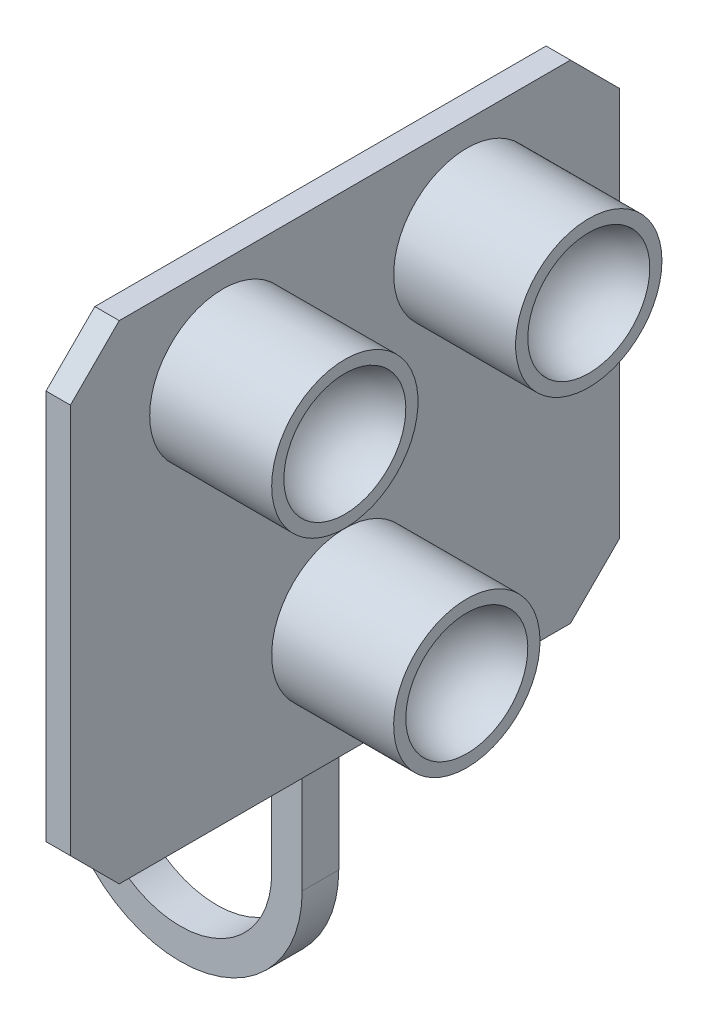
from build123d import *

# Parameters (mm, degrees)
SKETCH1_W           = 450
SKETCH1_H           = 400
BOSS_EXTRUDE1_DEPTH = 20
CHAMFER1_SIZE       = 40
BOSS_EXTRUDE2_DEPTH = 15
FILLET1_R           = 15


with BuildPart() as part:
    # Sketch1 → Boss-Extrude1 (new body)
    with BuildSketch(Plane(origin=(0, 0, 0), x_dir=(0, 0, -1), z_dir=(1, 0, 0))):
        with Locations((0, 200)):
            Rectangle(SKETCH1_W, SKETCH1_H)
    extrude(amount=-BOSS_EXTRUDE1_DEPTH)

    # Sketch2 → Revolve1 (revolve)
    with BuildSketch(Plane.XY):
        with BuildLine():
            Line((0, 40), (100, 40))
            Line((100, 40), (100, 50))
            ThreePointArc((100, 50), (64.644660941, 64.644660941), (50, 100))
            Line((50, 100), (0, 100))
            Line((0, 100), (0, 40))
        make_face()
    revolve(axis=Axis((0, 100, 0), (1, 0, 0)))

    # Sketch4 → Revolve2 (revolve)
    with BuildSketch(Plane.XY.offset(100), mode=Mode.PRIVATE) as revolve2_sk:
        with BuildLine():
            Line((0, 260), (100, 260))
            Line((100, 260), (100, 270))
            ThreePointArc((100, 270), (64.644660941, 284.644660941), (50, 320))
            Line((50, 320), (0, 320))
            Line((0, 320), (0, 260))
        make_face()
    revolve2 = revolve(revolve2_sk.sketch.rotate(Axis((0, 320, 100), (1, 0, 0)), 270), axis=Axis((0, 320, 100), (1, 0, 0)))

    # Mirror1: Revolve2 across plane
    add(revolve2.mirror(Plane.XY))

    # Chamfer1
    chamfer1_edges = [part.edges().sort_by_distance(p)[0] for p in [
        (-10, 400, 225),
        (-10, 400, -225),
        (-10, 0, -225),
        (-10, 0, 225),
    ]]
    chamfer(chamfer1_edges, length=CHAMFER1_SIZE)

    # Sketch5 → Boss-Extrude2 (add, symmetric)
    with BuildSketch(Plane.XY):
        with BuildLine():
            Line((-20, 360), (-20, -100))
            ThreePointArc((-20, -100), (-120, -200), (-220, -100))
            ThreePointArc((-220, -100), (-207.5, -87.5), (-195, -100))
            ThreePointArc((-195, -100), (-120, -175), (-45, -100))
            Line((-45, -100), (-45, 360))
            ThreePointArc((-45, 360), (-32.5, 372.5), (-20, 360))
        make_face()
    extrude(amount=BOSS_EXTRUDE2_DEPTH, both=True)

    # Fillet1
    fillet1_edges = [part.edges().sort_by_distance(p)[0] for p in [
        (-20, 180, -15),
        (-20, 180, 15),
    ]]
    fillet(fillet1_edges, radius=FILLET1_R)


solid = part.part
